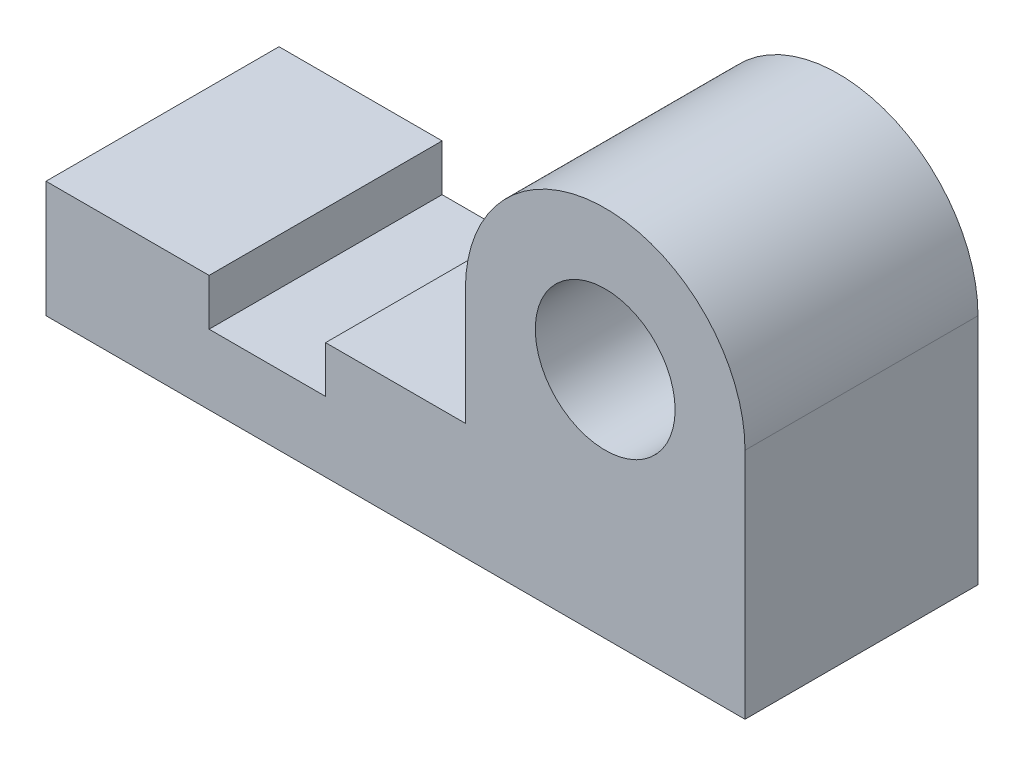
from build123d import *

# Parameters (mm, degrees)
SKETCH1_R           = 30
BOSS_EXTRUDE1_DEPTH = 100


with BuildPart() as part:
    # Sketch1 → Boss-Extrude1 (new body)
    with BuildSketch(Plane.XY):
        with BuildLine():
            Line((0, 0), (300, 0))
            Line((300, 0), (300, 100))
            ThreePointArc((300, 100), (240, 160), (180, 100))
            Line((180, 100), (180, 50))
            Line((180, 50), (120, 50))
            Line((120, 50), (120, 30))
            Line((120, 30), (70, 30))
            Line((70, 30), (70, 50))
            Line((70, 50), (0, 50))
            Line((0, 50), (0, 0))
        make_face()
        with Locations((240, 100)):
            Circle(SKETCH1_R, mode=Mode.SUBTRACT)
    extrude(amount=BOSS_EXTRUDE1_DEPTH)


solid = part.part
